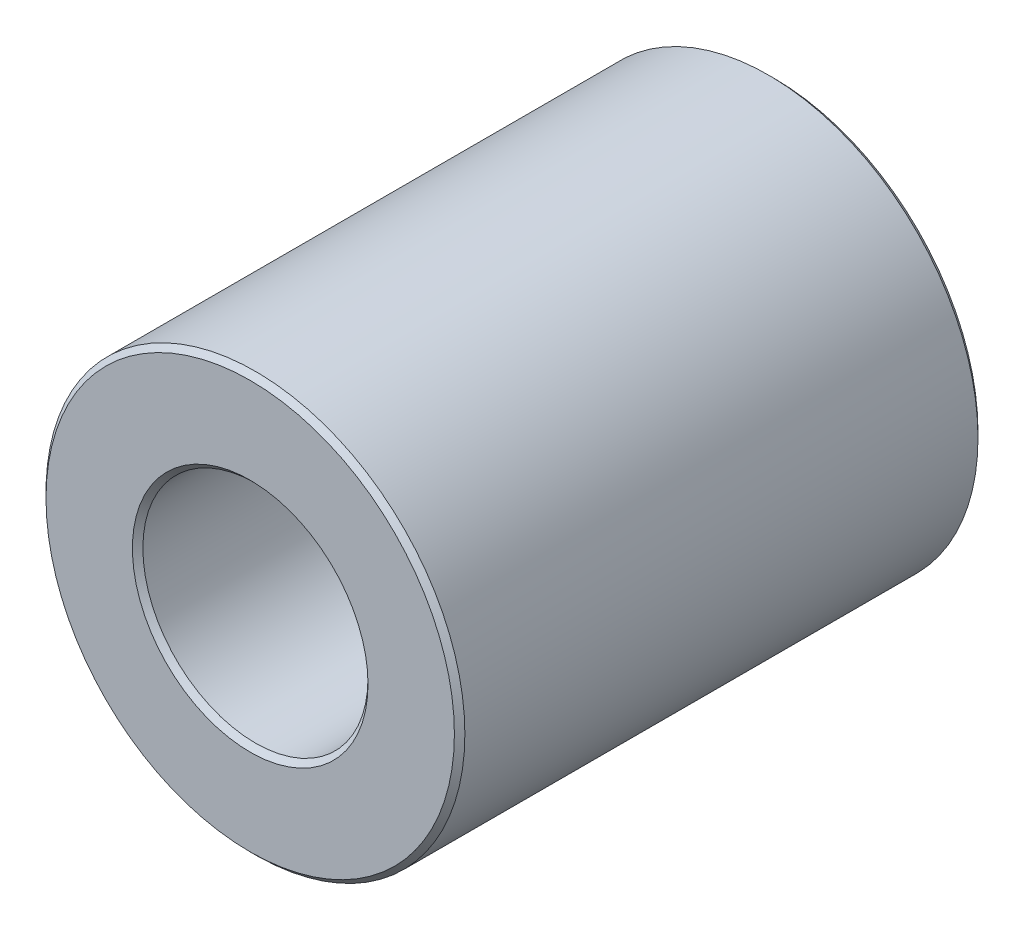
from build123d import *

# Parameters (mm, degrees)
SKETCH1_R           = 4
SKETCH1_R_2         = 2.15
BOSS_EXTRUDE2_DEPTH = 5
CHAMFER3_SIZE       = 0.1


with BuildPart() as part:
    # Sketch1 → Boss-Extrude2 (new, symmetric)
    with BuildSketch(Plane.XY):
        Circle(SKETCH1_R)
        Circle(SKETCH1_R_2, mode=Mode.SUBTRACT)
    extrude(amount=BOSS_EXTRUDE2_DEPTH, both=True)

    # Chamfer3
    chamfer3_edges = [part.edges().sort_by_distance(p)[0] for p in [
        (-4, 0, -5),
        (-4, 0, 5),
        (-2.15, 0, -5),
        (-2.15, 0, 5),
    ]]
    chamfer(chamfer3_edges, length=CHAMFER3_SIZE)


solid = part.part
